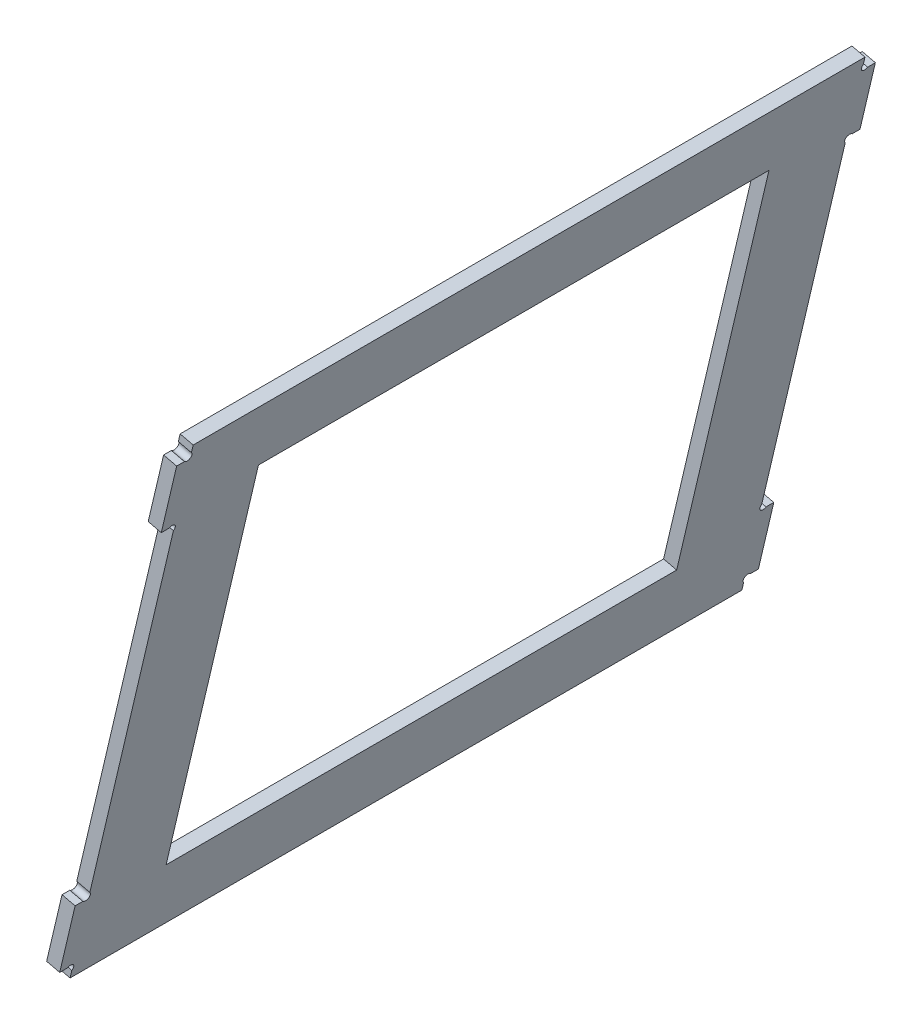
ISO-10303-21;
HEADER;
FILE_DESCRIPTION(('STEP AP214'),'2;1');
FILE_NAME('part.step','',(''),(''),'','','');
FILE_SCHEMA(('AUTOMOTIVE_DESIGN { 1 0 10303 214 1 1 1 1 }'));
ENDSEC;
DATA;
#1=APPLICATION_CONTEXT('core data for automotive mechanical design processes');
#2=APPLICATION_PROTOCOL_DEFINITION('international standard','automotive_design',2000,#1);
#3=PRODUCT_CONTEXT('',#1,'mechanical');
#4=PRODUCT('Part','Part','',(#3));
#5=PRODUCT_RELATED_PRODUCT_CATEGORY('part','',(#4));
#6=PRODUCT_DEFINITION_FORMATION('','',#4);
#7=PRODUCT_DEFINITION_CONTEXT('part definition',#1,'design');
#8=PRODUCT_DEFINITION('design','',#6,#7);
#9=PRODUCT_DEFINITION_SHAPE('','',#8);
#10=(LENGTH_UNIT() NAMED_UNIT(*) SI_UNIT(.MILLI.,.METRE.));
#11=(NAMED_UNIT(*) PLANE_ANGLE_UNIT() SI_UNIT($,.RADIAN.));
#12=(NAMED_UNIT(*) SI_UNIT($,.STERADIAN.) SOLID_ANGLE_UNIT());
#13=UNCERTAINTY_MEASURE_WITH_UNIT(LENGTH_MEASURE(1.E-05),#10,'distance_accuracy_value','');
#14=(GEOMETRIC_REPRESENTATION_CONTEXT(3) GLOBAL_UNCERTAINTY_ASSIGNED_CONTEXT((#13)) GLOBAL_UNIT_ASSIGNED_CONTEXT((#10,
#11,#12)) REPRESENTATION_CONTEXT('',''));
#15=CARTESIAN_POINT('',(0.,0.,0.));
#16=DIRECTION('',(0.,0.,1.));
#17=DIRECTION('',(1.,0.,0.));
#18=AXIS2_PLACEMENT_3D('',#15,#16,#17);
#19=CARTESIAN_POINT('',(-164.822751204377,648.878970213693,500.));
#20=DIRECTION('',(0.,0.,1.));
#21=DIRECTION('',(1.,0.,0.));
#22=AXIS2_PLACEMENT_3D('',#19,#20,#21);
#23=PLANE('',#22);
#24=DIRECTION('',(0.229075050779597,0.973408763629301,0.));
#25=VECTOR('',#24,1.);
#26=CARTESIAN_POINT('',(-228.485745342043,150.495036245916,500.));
#27=LINE('',#26,#25);
#28=CARTESIAN_POINT('',(-228.485745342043,150.495036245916,500.));
#29=VERTEX_POINT('',#28);
#30=CARTESIAN_POINT('',(-227.166877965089,156.099300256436,500.));
#31=VERTEX_POINT('',#30);
#32=EDGE_CURVE('E426',#29,#31,#27,.T.);
#33=ORIENTED_EDGE('',*,*,#32,.T.);
#34=DIRECTION('',(-0.973408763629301,0.2290750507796,0.));
#35=VECTOR('',#34,1.);
#36=CARTESIAN_POINT('',(-140.345177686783,135.667302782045,500.));
#37=LINE('',#36,#35);
#38=CARTESIAN_POINT('',(-236.900965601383,158.390050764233,500.));
#39=VERTEX_POINT('',#38);
#40=EDGE_CURVE('E273',#31,#39,#37,.T.);
#41=ORIENTED_EDGE('',*,*,#40,.T.);
#42=DIRECTION('',(-0.2290750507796,-0.973408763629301,0.));
#43=VECTOR('',#42,1.);
#44=CARTESIAN_POINT('',(-238.219832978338,152.785786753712,500.));
#45=LINE('',#44,#43);
#46=CARTESIAN_POINT('',(-238.219832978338,152.785786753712,500.));
#47=VERTEX_POINT('',#46);
#48=EDGE_CURVE('E438',#39,#47,#45,.T.);
#49=ORIENTED_EDGE('',*,*,#48,.T.);
#50=DIRECTION('',(0.973408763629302,-0.229075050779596,0.));
#51=VECTOR('',#50,1.);
#52=CARTESIAN_POINT('',(-238.219832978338,152.785786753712,500.));
#53=LINE('',#52,#51);
#54=EDGE_CURVE('E431',#47,#29,#53,.T.);
#55=ORIENTED_EDGE('',*,*,#54,.T.);
#56=EDGE_LOOP('',(#33,#41,#49,#55));
#57=FACE_BOUND('',#56,.T.);
#58=ADVANCED_FACE('F33',(#57),#23,.T.);
#59=CARTESIAN_POINT('',(-161.306198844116,479.6149427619,500.));
#60=VERTEX_POINT('',#59);
#61=CARTESIAN_POINT('',(-223.50344680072,215.320136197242,500.));
#62=VERTEX_POINT('',#61);
#63=EDGE_CURVE('E437',#60,#62,#45,.T.);
#64=ORIENTED_EDGE('',*,*,#63,.T.);
#65=DIRECTION('',(-0.973408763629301,0.2290750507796,0.));
#66=VECTOR('',#65,1.);
#67=CARTESIAN_POINT('',(-126.94765888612,192.597388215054,500.));
#68=LINE('',#67,#66);
#69=CARTESIAN_POINT('',(-213.769359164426,213.029385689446,500.));
#70=VERTEX_POINT('',#69);
#71=EDGE_CURVE('E254',#62,#70,#68,.F.);
#72=ORIENTED_EDGE('',*,*,#71,.T.);
#73=CARTESIAN_POINT('',(-151.572111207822,477.324192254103,500.));
#74=VERTEX_POINT('',#73);
#75=EDGE_CURVE('E253',#70,#74,#27,.T.);
#76=ORIENTED_EDGE('',*,*,#75,.T.);
#77=DIRECTION('',(-0.973408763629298,0.22907505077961,0.));
#78=VECTOR('',#77,1.);
#79=CARTESIAN_POINT('',(-64.7504109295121,456.89219477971,500.));
#80=LINE('',#79,#78);
#81=EDGE_CURVE('E280',#60,#74,#80,.F.);
#82=ORIENTED_EDGE('',*,*,#81,.F.);
#83=EDGE_LOOP('',(#64,#72,#76,#82));
#84=FACE_BOUND('',#83,.T.);
#85=ADVANCED_FACE('F497',(#84),#23,.T.);
#86=CARTESIAN_POINT('',(-226.194994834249,160.229123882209,500.));
#87=DIRECTION('',(0.2290750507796,0.973408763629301,0.));
#88=DIRECTION('',(-0.973408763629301,0.2290750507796,0.));
#89=AXIS2_PLACEMENT_3D('',#86,#87,#88);
#90=PLANE('',#89);
#91=DIRECTION('',(-0.973408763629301,0.2290750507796,0.));
#92=VECTOR('',#91,1.);
#93=CARTESIAN_POINT('',(-139.373294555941,139.797126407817,504.242640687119));
#94=LINE('',#93,#92);
#95=CARTESIAN_POINT('',(-226.194994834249,160.229123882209,504.242640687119));
#96=VERTEX_POINT('',#95);
#97=CARTESIAN_POINT('',(-235.929082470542,162.519874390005,504.242640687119));
#98=VERTEX_POINT('',#97);
#99=EDGE_CURVE('E11',#96,#98,#94,.T.);
#100=ORIENTED_EDGE('',*,*,#99,.F.);
#101=DIRECTION('',(0.,0.,-1.));
#102=VECTOR('',#101,1.);
#103=CARTESIAN_POINT('',(-226.194994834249,160.229123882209,500.));
#104=LINE('',#103,#102);
#105=CARTESIAN_POINT('',(-226.194994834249,160.229123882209,510.));
#106=VERTEX_POINT('',#105);
#107=EDGE_CURVE('E265',#106,#96,#104,.T.);
#108=ORIENTED_EDGE('',*,*,#107,.F.);
#109=DIRECTION('',(-0.973408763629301,0.2290750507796,0.));
#110=VECTOR('',#109,1.);
#111=CARTESIAN_POINT('',(-226.194994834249,160.229123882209,510.));
#112=LINE('',#111,#110);
#113=CARTESIAN_POINT('',(-235.929082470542,162.519874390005,510.));
#114=VERTEX_POINT('',#113);
#115=EDGE_CURVE('E260',#106,#114,#112,.T.);
#116=ORIENTED_EDGE('',*,*,#115,.T.);
#117=DIRECTION('',(0.,0.,-1.));
#118=VECTOR('',#117,1.);
#119=CARTESIAN_POINT('',(-235.929082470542,162.519874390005,500.));
#120=LINE('',#119,#118);
#121=EDGE_CURVE('E269',#114,#98,#120,.T.);
#122=ORIENTED_EDGE('',*,*,#121,.T.);
#123=EDGE_LOOP('',(#100,#108,#116,#122));
#124=FACE_BOUND('',#123,.T.);
#125=ADVANCED_FACE('F555',(#124),#90,.F.);
#126=CARTESIAN_POINT('',(-214.741242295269,208.899562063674,500.));
#127=DIRECTION('',(-0.2290750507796,-0.973408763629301,0.));
#128=DIRECTION('',(0.973408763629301,-0.2290750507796,0.));
#129=AXIS2_PLACEMENT_3D('',#126,#127,#128);
#130=PLANE('',#129);
#131=DIRECTION('',(-0.973408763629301,0.2290750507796,0.));
#132=VECTOR('',#131,1.);
#133=CARTESIAN_POINT('',(-127.919542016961,188.467564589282,504.242640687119));
#134=LINE('',#133,#132);
#135=CARTESIAN_POINT('',(-224.475329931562,211.19031257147,504.242640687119));
#136=VERTEX_POINT('',#135);
#137=CARTESIAN_POINT('',(-214.741242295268,208.899562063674,504.242640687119));
#138=VERTEX_POINT('',#137);
#139=EDGE_CURVE('E41',#136,#138,#134,.F.);
#140=ORIENTED_EDGE('',*,*,#139,.F.);
#141=DIRECTION('',(0.,0.,1.));
#142=VECTOR('',#141,1.);
#143=CARTESIAN_POINT('',(-224.475329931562,211.19031257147,500.));
#144=LINE('',#143,#142);
#145=CARTESIAN_POINT('',(-224.475329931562,211.19031257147,510.));
#146=VERTEX_POINT('',#145);
#147=EDGE_CURVE('E275',#136,#146,#144,.T.);
#148=ORIENTED_EDGE('',*,*,#147,.T.);
#149=DIRECTION('',(-0.973408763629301,0.2290750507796,0.));
#150=VECTOR('',#149,1.);
#151=CARTESIAN_POINT('',(-214.741242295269,208.899562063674,510.));
#152=LINE('',#151,#150);
#153=CARTESIAN_POINT('',(-214.741242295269,208.899562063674,510.));
#154=VERTEX_POINT('',#153);
#155=EDGE_CURVE('E258',#154,#146,#152,.T.);
#156=ORIENTED_EDGE('',*,*,#155,.F.);
#157=DIRECTION('',(0.,0.,1.));
#158=VECTOR('',#157,1.);
#159=CARTESIAN_POINT('',(-214.741242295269,208.899562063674,500.));
#160=LINE('',#159,#158);
#161=EDGE_CURVE('E250',#138,#154,#160,.T.);
#162=ORIENTED_EDGE('',*,*,#161,.F.);
#163=EDGE_LOOP('',(#140,#148,#156,#162));
#164=FACE_BOUND('',#163,.T.);
#165=ADVANCED_FACE('F256',(#164),#130,.F.);
#166=CARTESIAN_POINT('',(0.,0.,0.));
#167=DIRECTION('',(0.,0.,-1.));
#168=DIRECTION('',(-1.,0.,0.));
#169=AXIS2_PLACEMENT_3D('',#166,#167,#168);
#170=PLANE('',#169);
#171=DIRECTION('',(0.229075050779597,0.973408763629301,0.));
#172=VECTOR('',#171,1.);
#173=CARTESIAN_POINT('',(-228.485745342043,150.495036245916,0.));
#174=LINE('',#173,#172);
#175=CARTESIAN_POINT('',(-138.17459240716,534.254277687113,0.));
#176=VERTEX_POINT('',#175);
#177=CARTESIAN_POINT('',(-136.855725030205,539.858541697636,0.));
#178=VERTEX_POINT('',#177);
#179=EDGE_CURVE('E415',#176,#178,#174,.T.);
#180=ORIENTED_EDGE('',*,*,#179,.F.);
#181=DIRECTION('',(-0.973408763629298,0.22907505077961,0.));
#182=VECTOR('',#181,1.);
#183=CARTESIAN_POINT('',(-51.3528921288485,513.822280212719,0.));
#184=LINE('',#183,#182);
#185=CARTESIAN_POINT('',(-147.908680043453,536.545028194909,0.));
#186=VERTEX_POINT('',#185);
#187=EDGE_CURVE('E324',#176,#186,#184,.T.);
#188=ORIENTED_EDGE('',*,*,#187,.T.);
#189=DIRECTION('',(-0.2290750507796,-0.973408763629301,0.));
#190=VECTOR('',#189,1.);
#191=CARTESIAN_POINT('',(-238.219832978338,152.785786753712,0.));
#192=LINE('',#191,#190);
#193=CARTESIAN_POINT('',(-146.589812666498,542.149292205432,0.));
#194=VERTEX_POINT('',#193);
#195=EDGE_CURVE('E421',#194,#186,#192,.T.);
#196=ORIENTED_EDGE('',*,*,#195,.F.);
#197=DIRECTION('',(-0.973408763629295,0.229075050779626,0.));
#198=VECTOR('',#197,1.);
#199=CARTESIAN_POINT('',(-146.589812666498,542.149292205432,0.));
#200=LINE('',#199,#198);
#201=EDGE_CURVE('E406',#178,#194,#200,.T.);
#202=ORIENTED_EDGE('',*,*,#201,.F.);
#203=EDGE_LOOP('',(#180,#188,#196,#202));
#204=FACE_BOUND('',#203,.T.);
#205=ADVANCED_FACE('F537',(#204),#170,.T.);
#206=CARTESIAN_POINT('',(-161.306198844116,479.6149427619,0.));
#207=VERTEX_POINT('',#206);
#208=CARTESIAN_POINT('',(-223.50344680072,215.320136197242,0.));
#209=VERTEX_POINT('',#208);
#210=EDGE_CURVE('E424',#207,#209,#192,.T.);
#211=ORIENTED_EDGE('',*,*,#210,.F.);
#212=DIRECTION('',(-0.973408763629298,0.22907505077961,0.));
#213=VECTOR('',#212,1.);
#214=CARTESIAN_POINT('',(-64.750410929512,456.89219477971,0.));
#215=LINE('',#214,#213);
#216=CARTESIAN_POINT('',(-151.572111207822,477.324192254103,0.));
#217=VERTEX_POINT('',#216);
#218=EDGE_CURVE('E311',#207,#217,#215,.F.);
#219=ORIENTED_EDGE('',*,*,#218,.T.);
#220=CARTESIAN_POINT('',(-213.769359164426,213.029385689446,0.));
#221=VERTEX_POINT('',#220);
#222=EDGE_CURVE('E414',#221,#217,#174,.T.);
#223=ORIENTED_EDGE('',*,*,#222,.F.);
#224=DIRECTION('',(-0.973408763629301,0.2290750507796,0.));
#225=VECTOR('',#224,1.);
#226=CARTESIAN_POINT('',(-126.94765888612,192.597388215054,0.));
#227=LINE('',#226,#225);
#228=EDGE_CURVE('E350',#209,#221,#227,.F.);
#229=ORIENTED_EDGE('',*,*,#228,.F.);
#230=EDGE_LOOP('',(#211,#219,#223,#229));
#231=FACE_BOUND('',#230,.T.);
#232=ADVANCED_FACE('F525',(#231),#170,.T.);
#233=CARTESIAN_POINT('',(-139.146475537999,530.12445406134,0.));
#234=DIRECTION('',(-0.22907505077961,-0.973408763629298,0.));
#235=DIRECTION('',(0.973408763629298,-0.22907505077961,0.));
#236=AXIS2_PLACEMENT_3D('',#233,#234,#235);
#237=PLANE('',#236);
#238=DIRECTION('',(-0.973408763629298,0.22907505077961,0.));
#239=VECTOR('',#238,1.);
#240=CARTESIAN_POINT('',(-52.32477525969,509.692456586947,-4.24264068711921));
#241=LINE('',#240,#239);
#242=CARTESIAN_POINT('',(-139.146475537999,530.12445406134,-4.24264068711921));
#243=VERTEX_POINT('',#242);
#244=CARTESIAN_POINT('',(-148.880563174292,532.415204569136,-4.24264068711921));
#245=VERTEX_POINT('',#244);
#246=EDGE_CURVE('E466',#243,#245,#241,.T.);
#247=ORIENTED_EDGE('',*,*,#246,.F.);
#248=DIRECTION('',(0.,0.,1.));
#249=VECTOR('',#248,1.);
#250=CARTESIAN_POINT('',(-139.146475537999,530.12445406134,0.));
#251=LINE('',#250,#249);
#252=CARTESIAN_POINT('',(-139.146475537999,530.12445406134,-10.));
#253=VERTEX_POINT('',#252);
#254=EDGE_CURVE('E328',#253,#243,#251,.T.);
#255=ORIENTED_EDGE('',*,*,#254,.F.);
#256=DIRECTION('',(-0.973408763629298,0.22907505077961,0.));
#257=VECTOR('',#256,1.);
#258=CARTESIAN_POINT('',(-139.146475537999,530.12445406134,-10.));
#259=LINE('',#258,#257);
#260=CARTESIAN_POINT('',(-148.880563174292,532.415204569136,-10.));
#261=VERTEX_POINT('',#260);
#262=EDGE_CURVE('E336',#253,#261,#259,.T.);
#263=ORIENTED_EDGE('',*,*,#262,.T.);
#264=DIRECTION('',(0.,0.,1.));
#265=VECTOR('',#264,1.);
#266=CARTESIAN_POINT('',(-148.880563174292,532.415204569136,0.));
#267=LINE('',#266,#265);
#268=EDGE_CURVE('E327',#261,#245,#267,.T.);
#269=ORIENTED_EDGE('',*,*,#268,.T.);
#270=EDGE_LOOP('',(#247,#255,#263,#269));
#271=FACE_BOUND('',#270,.T.);
#272=ADVANCED_FACE('F590',(#271),#237,.F.);
#273=CARTESIAN_POINT('',(-150.60022807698,481.454015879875,0.));
#274=DIRECTION('',(0.22907505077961,0.973408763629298,0.));
#275=DIRECTION('',(-0.973408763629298,0.22907505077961,0.));
#276=AXIS2_PLACEMENT_3D('',#273,#274,#275);
#277=PLANE('',#276);
#278=DIRECTION('',(-0.973408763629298,0.22907505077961,0.));
#279=VECTOR('',#278,1.);
#280=CARTESIAN_POINT('',(-63.7785277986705,461.022018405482,-4.24264068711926));
#281=LINE('',#280,#279);
#282=CARTESIAN_POINT('',(-160.334315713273,483.744766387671,-4.24264068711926));
#283=VERTEX_POINT('',#282);
#284=CARTESIAN_POINT('',(-150.60022807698,481.454015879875,-4.24264068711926));
#285=VERTEX_POINT('',#284);
#286=EDGE_CURVE('E464',#283,#285,#281,.F.);
#287=ORIENTED_EDGE('',*,*,#286,.F.);
#288=DIRECTION('',(0.,0.,-1.));
#289=VECTOR('',#288,1.);
#290=CARTESIAN_POINT('',(-160.334315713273,483.744766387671,0.));
#291=LINE('',#290,#289);
#292=CARTESIAN_POINT('',(-160.334315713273,483.744766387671,-10.));
#293=VERTEX_POINT('',#292);
#294=EDGE_CURVE('E332',#283,#293,#291,.T.);
#295=ORIENTED_EDGE('',*,*,#294,.T.);
#296=DIRECTION('',(-0.973408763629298,0.22907505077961,0.));
#297=VECTOR('',#296,1.);
#298=CARTESIAN_POINT('',(-150.60022807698,481.454015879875,-10.));
#299=LINE('',#298,#297);
#300=CARTESIAN_POINT('',(-150.60022807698,481.454015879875,-10.));
#301=VERTEX_POINT('',#300);
#302=EDGE_CURVE('E342',#301,#293,#299,.T.);
#303=ORIENTED_EDGE('',*,*,#302,.F.);
#304=DIRECTION('',(0.,0.,-1.));
#305=VECTOR('',#304,1.);
#306=CARTESIAN_POINT('',(-150.60022807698,481.454015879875,0.));
#307=LINE('',#306,#305);
#308=EDGE_CURVE('E334',#285,#301,#307,.T.);
#309=ORIENTED_EDGE('',*,*,#308,.F.);
#310=EDGE_LOOP('',(#287,#295,#303,#309));
#311=FACE_BOUND('',#310,.T.);
#312=ADVANCED_FACE('F587',(#311),#277,.F.);
#313=CARTESIAN_POINT('',(-238.219832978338,152.785786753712,904.558696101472));
#314=DIRECTION('',(0.973408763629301,-0.2290750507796,0.));
#315=DIRECTION('',(0.2290750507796,0.973408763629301,0.));
#316=AXIS2_PLACEMENT_3D('',#313,#314,#315);
#317=PLANE('',#316);
#318=ORIENTED_EDGE('',*,*,#48,.F.);
#319=CARTESIAN_POINT('',(-236.415024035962,160.454962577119,502.12132034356));
#320=DIRECTION('',(0.973408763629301,-0.2290750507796,0.));
#321=DIRECTION('',(0.2290750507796,0.973408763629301,0.));
#322=AXIS2_PLACEMENT_3D('',#319,#320,#321);
#323=CIRCLE('',#322,3.00000000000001);
#324=EDGE_CURVE('E861',#98,#39,#323,.F.);
#325=ORIENTED_EDGE('',*,*,#324,.F.);
#326=ORIENTED_EDGE('',*,*,#121,.F.);
#327=DIRECTION('',(-0.2290750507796,-0.973408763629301,0.));
#328=VECTOR('',#327,1.);
#329=CARTESIAN_POINT('',(-235.929082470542,162.519874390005,510.));
#330=LINE('',#329,#328);
#331=EDGE_CURVE('E272',#146,#114,#330,.T.);
#332=ORIENTED_EDGE('',*,*,#331,.F.);
#333=ORIENTED_EDGE('',*,*,#147,.F.);
#334=CARTESIAN_POINT('',(-223.989388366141,213.255224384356,502.12132034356));
#335=DIRECTION('',(0.973408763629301,-0.2290750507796,0.));
#336=DIRECTION('',(0.2290750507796,0.973408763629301,0.));
#337=AXIS2_PLACEMENT_3D('',#334,#335,#336);
#338=CIRCLE('',#337,3.);
#339=EDGE_CURVE('E55',#62,#136,#338,.F.);
#340=ORIENTED_EDGE('',*,*,#339,.F.);
#341=ORIENTED_EDGE('',*,*,#63,.F.);
#342=CARTESIAN_POINT('',(-160.820257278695,481.679854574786,502.12132034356));
#343=DIRECTION('',(0.973408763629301,-0.2290750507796,0.));
#344=DIRECTION('',(0.2290750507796,0.973408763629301,0.));
#345=AXIS2_PLACEMENT_3D('',#342,#343,#344);
#346=CIRCLE('',#345,3.);
#347=CARTESIAN_POINT('',(-160.334315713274,483.744766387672,504.242640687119));
#348=VERTEX_POINT('',#347);
#349=EDGE_CURVE('E281',#60,#348,#346,.T.);
#350=ORIENTED_EDGE('',*,*,#349,.T.);
#351=DIRECTION('',(0.,0.,1.));
#352=VECTOR('',#351,1.);
#353=CARTESIAN_POINT('',(-160.334315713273,483.744766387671,500.));
#354=LINE('',#353,#352);
#355=CARTESIAN_POINT('',(-160.334315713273,483.744766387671,510.));
#356=VERTEX_POINT('',#355);
#357=EDGE_CURVE('E305',#348,#356,#354,.T.);
#358=ORIENTED_EDGE('',*,*,#357,.T.);
#359=DIRECTION('',(0.22907505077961,0.973408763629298,0.));
#360=VECTOR('',#359,1.);
#361=CARTESIAN_POINT('',(-148.880563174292,532.415204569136,510.));
#362=LINE('',#361,#360);
#363=CARTESIAN_POINT('',(-148.880563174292,532.415204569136,510.));
#364=VERTEX_POINT('',#363);
#365=EDGE_CURVE('E297',#356,#364,#362,.T.);
#366=ORIENTED_EDGE('',*,*,#365,.T.);
#367=DIRECTION('',(0.,0.,-1.));
#368=VECTOR('',#367,1.);
#369=CARTESIAN_POINT('',(-148.880563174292,532.415204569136,500.));
#370=LINE('',#369,#368);
#371=CARTESIAN_POINT('',(-148.880563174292,532.415204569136,504.242640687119));
#372=VERTEX_POINT('',#371);
#373=EDGE_CURVE('E291',#364,#372,#370,.T.);
#374=ORIENTED_EDGE('',*,*,#373,.T.);
#375=CARTESIAN_POINT('',(-148.394621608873,534.480116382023,502.12132034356));
#376=DIRECTION('',(0.973408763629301,-0.2290750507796,0.));
#377=DIRECTION('',(0.2290750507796,0.973408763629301,0.));
#378=AXIS2_PLACEMENT_3D('',#375,#376,#377);
#379=CIRCLE('',#378,3.00000000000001);
#380=CARTESIAN_POINT('',(-147.908680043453,536.545028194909,500.));
#381=VERTEX_POINT('',#380);
#382=EDGE_CURVE('E288',#372,#381,#379,.T.);
#383=ORIENTED_EDGE('',*,*,#382,.T.);
#384=CARTESIAN_POINT('',(-146.589812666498,542.149292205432,500.));
#385=VERTEX_POINT('',#384);
#386=EDGE_CURVE('E434',#385,#381,#45,.T.);
#387=ORIENTED_EDGE('',*,*,#386,.F.);
#388=DIRECTION('',(0.,0.,-1.));
#389=VECTOR('',#388,1.);
#390=CARTESIAN_POINT('',(-146.589812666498,542.149292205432,904.558696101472));
#391=LINE('',#390,#389);
#392=EDGE_CURVE('E405',#385,#194,#391,.T.);
#393=ORIENTED_EDGE('',*,*,#392,.T.);
#394=ORIENTED_EDGE('',*,*,#195,.T.);
#395=CARTESIAN_POINT('',(-148.394621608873,534.480116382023,-2.12132034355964));
#396=DIRECTION('',(0.973408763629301,-0.2290750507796,0.));
#397=DIRECTION('',(0.2290750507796,0.973408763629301,0.));
#398=AXIS2_PLACEMENT_3D('',#395,#396,#397);
#399=CIRCLE('',#398,3.00000000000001);
#400=EDGE_CURVE('E322',#245,#186,#399,.F.);
#401=ORIENTED_EDGE('',*,*,#400,.F.);
#402=ORIENTED_EDGE('',*,*,#268,.F.);
#403=DIRECTION('',(0.22907505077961,0.973408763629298,0.));
#404=VECTOR('',#403,1.);
#405=CARTESIAN_POINT('',(-148.880563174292,532.415204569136,-10.));
#406=LINE('',#405,#404);
#407=EDGE_CURVE('E339',#293,#261,#406,.T.);
#408=ORIENTED_EDGE('',*,*,#407,.F.);
#409=ORIENTED_EDGE('',*,*,#294,.F.);
#410=CARTESIAN_POINT('',(-160.820257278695,481.679854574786,-2.12132034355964));
#411=DIRECTION('',(0.973408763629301,-0.2290750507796,0.));
#412=DIRECTION('',(0.2290750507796,0.973408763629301,0.));
#413=AXIS2_PLACEMENT_3D('',#410,#411,#412);
#414=CIRCLE('',#413,3.);
#415=EDGE_CURVE('E316',#207,#283,#414,.F.);
#416=ORIENTED_EDGE('',*,*,#415,.F.);
#417=ORIENTED_EDGE('',*,*,#210,.T.);
#418=CARTESIAN_POINT('',(-223.989388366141,213.255224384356,-2.12132034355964));
#419=DIRECTION('',(0.973408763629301,-0.2290750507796,0.));
#420=DIRECTION('',(0.2290750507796,0.973408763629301,0.));
#421=AXIS2_PLACEMENT_3D('',#418,#419,#420);
#422=CIRCLE('',#421,3.);
#423=CARTESIAN_POINT('',(-224.475329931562,211.19031257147,-4.24264068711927));
#424=VERTEX_POINT('',#423);
#425=EDGE_CURVE('E351',#209,#424,#422,.T.);
#426=ORIENTED_EDGE('',*,*,#425,.T.);
#427=DIRECTION('',(0.,0.,-1.));
#428=VECTOR('',#427,1.);
#429=CARTESIAN_POINT('',(-224.475329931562,211.19031257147,0.));
#430=LINE('',#429,#428);
#431=CARTESIAN_POINT('',(-224.475329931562,211.19031257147,-10.));
#432=VERTEX_POINT('',#431);
#433=EDGE_CURVE('E374',#424,#432,#430,.T.);
#434=ORIENTED_EDGE('',*,*,#433,.T.);
#435=DIRECTION('',(-0.2290750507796,-0.973408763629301,0.));
#436=VECTOR('',#435,1.);
#437=CARTESIAN_POINT('',(-235.929082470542,162.519874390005,-10.));
#438=LINE('',#437,#436);
#439=CARTESIAN_POINT('',(-235.929082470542,162.519874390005,-10.));
#440=VERTEX_POINT('',#439);
#441=EDGE_CURVE('E366',#432,#440,#438,.T.);
#442=ORIENTED_EDGE('',*,*,#441,.T.);
#443=DIRECTION('',(0.,0.,1.));
#444=VECTOR('',#443,1.);
#445=CARTESIAN_POINT('',(-235.929082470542,162.519874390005,0.));
#446=LINE('',#445,#444);
#447=CARTESIAN_POINT('',(-235.929082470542,162.519874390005,-4.24264068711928));
#448=VERTEX_POINT('',#447);
#449=EDGE_CURVE('E361',#440,#448,#446,.T.);
#450=ORIENTED_EDGE('',*,*,#449,.T.);
#451=CARTESIAN_POINT('',(-236.415024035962,160.454962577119,-2.12132034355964));
#452=DIRECTION('',(0.973408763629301,-0.2290750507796,0.));
#453=DIRECTION('',(0.2290750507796,0.973408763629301,0.));
#454=AXIS2_PLACEMENT_3D('',#451,#452,#453);
#455=CIRCLE('',#454,3.00000000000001);
#456=CARTESIAN_POINT('',(-236.900965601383,158.390050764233,0.));
#457=VERTEX_POINT('',#456);
#458=EDGE_CURVE('E356',#448,#457,#455,.T.);
#459=ORIENTED_EDGE('',*,*,#458,.T.);
#460=CARTESIAN_POINT('',(-238.219832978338,152.785786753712,0.));
#461=VERTEX_POINT('',#460);
#462=EDGE_CURVE('E425',#457,#461,#192,.T.);
#463=ORIENTED_EDGE('',*,*,#462,.T.);
#464=DIRECTION('',(0.,0.,-1.));
#465=VECTOR('',#464,1.);
#466=CARTESIAN_POINT('',(-238.219832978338,152.785786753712,904.558696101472));
#467=LINE('',#466,#465);
#468=EDGE_CURVE('E420',#47,#461,#467,.T.);
#469=ORIENTED_EDGE('',*,*,#468,.F.);
#470=EDGE_LOOP('',(#318,#325,#326,#332,#333,#340,#341,#350,#358,#366,#374,#383,#387,#393,#394,
#401,#402,#408,#409,#416,#417,#426,#434,#442,#450,#459,#463,#469));
#471=FACE_BOUND('',#470,.T.);
#472=DIRECTION('',(0.,0.,-1.));
#473=VECTOR('',#472,1.);
#474=CARTESIAN_POINT('',(-226.766080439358,201.456224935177,904.558696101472));
#475=LINE('',#474,#473);
#476=CARTESIAN_POINT('',(-226.766080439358,201.456224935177,440.));
#477=VERTEX_POINT('',#476);
#478=CARTESIAN_POINT('',(-226.766080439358,201.456224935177,60.0000000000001));
#479=VERTEX_POINT('',#478);
#480=EDGE_CURVE('E386',#477,#479,#475,.T.);
#481=ORIENTED_EDGE('',*,*,#480,.T.);
#482=DIRECTION('',(0.2290750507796,0.973408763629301,0.));
#483=VECTOR('',#482,1.);
#484=CARTESIAN_POINT('',(-238.219832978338,152.785786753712,60.0000000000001));
#485=LINE('',#484,#483);
#486=CARTESIAN_POINT('',(-158.043565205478,493.478854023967,60.0000000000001));
#487=VERTEX_POINT('',#486);
#488=EDGE_CURVE('E402',#479,#487,#485,.T.);
#489=ORIENTED_EDGE('',*,*,#488,.T.);
#490=DIRECTION('',(0.,0.,1.));
#491=VECTOR('',#490,1.);
#492=CARTESIAN_POINT('',(-158.043565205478,493.478854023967,904.558696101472));
#493=LINE('',#492,#491);
#494=CARTESIAN_POINT('',(-158.043565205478,493.478854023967,440.));
#495=VERTEX_POINT('',#494);
#496=EDGE_CURVE('E399',#487,#495,#493,.T.);
#497=ORIENTED_EDGE('',*,*,#496,.T.);
#498=DIRECTION('',(-0.2290750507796,-0.973408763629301,0.));
#499=VECTOR('',#498,1.);
#500=CARTESIAN_POINT('',(-238.219832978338,152.785786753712,440.));
#501=LINE('',#500,#499);
#502=EDGE_CURVE('E396',#495,#477,#501,.T.);
#503=ORIENTED_EDGE('',*,*,#502,.T.);
#504=EDGE_LOOP('',(#481,#489,#497,#503));
#505=FACE_BOUND('',#504,.T.);
#506=ADVANCED_FACE('F500',(#471,#505),#317,.F.);
#507=CARTESIAN_POINT('',(-238.219832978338,152.785786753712,904.558696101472));
#508=DIRECTION('',(0.229075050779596,0.973408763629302,0.));
#509=DIRECTION('',(-0.973408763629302,0.229075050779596,0.));
#510=AXIS2_PLACEMENT_3D('',#507,#508,#509);
#511=PLANE('',#510);
#512=ORIENTED_EDGE('',*,*,#54,.F.);
#513=ORIENTED_EDGE('',*,*,#468,.T.);
#514=DIRECTION('',(0.973408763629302,-0.229075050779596,0.));
#515=VECTOR('',#514,1.);
#516=CARTESIAN_POINT('',(-238.219832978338,152.785786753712,0.));
#517=LINE('',#516,#515);
#518=CARTESIAN_POINT('',(-228.485745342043,150.495036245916,0.));
#519=VERTEX_POINT('',#518);
#520=EDGE_CURVE('E416',#461,#519,#517,.T.);
#521=ORIENTED_EDGE('',*,*,#520,.T.);
#522=DIRECTION('',(0.,0.,-1.));
#523=VECTOR('',#522,1.);
#524=CARTESIAN_POINT('',(-228.485745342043,150.495036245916,904.558696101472));
#525=LINE('',#524,#523);
#526=EDGE_CURVE('E419',#29,#519,#525,.T.);
#527=ORIENTED_EDGE('',*,*,#526,.F.);
#528=EDGE_LOOP('',(#512,#513,#521,#527));
#529=FACE_BOUND('',#528,.T.);
#530=ADVANCED_FACE('F509',(#529),#511,.F.);
#531=CARTESIAN_POINT('',(-228.485745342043,150.495036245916,904.558696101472));
#532=DIRECTION('',(-0.973408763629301,0.229075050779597,0.));
#533=DIRECTION('',(-0.229075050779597,-0.973408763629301,0.));
#534=AXIS2_PLACEMENT_3D('',#531,#532,#533);
#535=PLANE('',#534);
#536=CARTESIAN_POINT('',(-226.680936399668,158.164212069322,502.12132034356));
#537=DIRECTION('',(-0.973408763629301,0.229075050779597,0.));
#538=DIRECTION('',(-0.229075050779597,-0.973408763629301,0.));
#539=AXIS2_PLACEMENT_3D('',#536,#537,#538);
#540=CIRCLE('',#539,3.00000000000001);
#541=EDGE_CURVE('E47',#31,#96,#540,.F.);
#542=ORIENTED_EDGE('',*,*,#541,.F.);
#543=ORIENTED_EDGE('',*,*,#32,.F.);
#544=ORIENTED_EDGE('',*,*,#526,.T.);
#545=CARTESIAN_POINT('',(-227.166877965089,156.099300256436,0.));
#546=VERTEX_POINT('',#545);
#547=EDGE_CURVE('E411',#519,#546,#174,.T.);
#548=ORIENTED_EDGE('',*,*,#547,.T.);
#549=CARTESIAN_POINT('',(-226.680936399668,158.164212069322,-2.12132034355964));
#550=DIRECTION('',(-0.973408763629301,0.229075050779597,0.));
#551=DIRECTION('',(-0.229075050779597,-0.973408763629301,0.));
#552=AXIS2_PLACEMENT_3D('',#549,#550,#551);
#553=CIRCLE('',#552,3.00000000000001);
#554=CARTESIAN_POINT('',(-226.194994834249,160.229123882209,-4.24264068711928));
#555=VERTEX_POINT('',#554);
#556=EDGE_CURVE('E353',#546,#555,#553,.T.);
#557=ORIENTED_EDGE('',*,*,#556,.T.);
#558=DIRECTION('',(0.,0.,1.));
#559=VECTOR('',#558,1.);
#560=CARTESIAN_POINT('',(-226.194994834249,160.229123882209,0.));
#561=LINE('',#560,#559);
#562=CARTESIAN_POINT('',(-226.194994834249,160.229123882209,-10.));
#563=VERTEX_POINT('',#562);
#564=EDGE_CURVE('E362',#563,#555,#561,.T.);
#565=ORIENTED_EDGE('',*,*,#564,.F.);
#566=DIRECTION('',(-0.2290750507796,-0.973408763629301,0.));
#567=VECTOR('',#566,1.);
#568=CARTESIAN_POINT('',(-226.194994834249,160.229123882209,-10.));
#569=LINE('',#568,#567);
#570=CARTESIAN_POINT('',(-214.741242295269,208.899562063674,-10.));
#571=VERTEX_POINT('',#570);
#572=EDGE_CURVE('E368',#571,#563,#569,.T.);
#573=ORIENTED_EDGE('',*,*,#572,.F.);
#574=DIRECTION('',(0.,0.,-1.));
#575=VECTOR('',#574,1.);
#576=CARTESIAN_POINT('',(-214.741242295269,208.899562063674,0.));
#577=LINE('',#576,#575);
#578=CARTESIAN_POINT('',(-214.741242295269,208.899562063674,-4.24264068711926));
#579=VERTEX_POINT('',#578);
#580=EDGE_CURVE('E365',#579,#571,#577,.T.);
#581=ORIENTED_EDGE('',*,*,#580,.F.);
#582=CARTESIAN_POINT('',(-214.255300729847,210.96447387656,-2.12132034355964));
#583=DIRECTION('',(-0.973408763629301,0.229075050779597,0.));
#584=DIRECTION('',(-0.229075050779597,-0.973408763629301,0.));
#585=AXIS2_PLACEMENT_3D('',#582,#583,#584);
#586=CIRCLE('',#585,3.);
#587=EDGE_CURVE('E345',#579,#221,#586,.T.);
#588=ORIENTED_EDGE('',*,*,#587,.T.);
#589=ORIENTED_EDGE('',*,*,#222,.T.);
#590=CARTESIAN_POINT('',(-151.086169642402,479.38910406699,-2.12132034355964));
#591=DIRECTION('',(-0.973408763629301,0.229075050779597,0.));
#592=DIRECTION('',(-0.229075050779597,-0.973408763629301,0.));
#593=AXIS2_PLACEMENT_3D('',#590,#591,#592);
#594=CIRCLE('',#593,3.);
#595=EDGE_CURVE('E314',#285,#217,#594,.F.);
#596=ORIENTED_EDGE('',*,*,#595,.F.);
#597=ORIENTED_EDGE('',*,*,#308,.T.);
#598=DIRECTION('',(0.22907505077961,0.973408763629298,0.));
#599=VECTOR('',#598,1.);
#600=CARTESIAN_POINT('',(-139.146475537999,530.12445406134,-10.));
#601=LINE('',#600,#599);
#602=EDGE_CURVE('E331',#301,#253,#601,.T.);
#603=ORIENTED_EDGE('',*,*,#602,.T.);
#604=ORIENTED_EDGE('',*,*,#254,.T.);
#605=CARTESIAN_POINT('',(-138.66053397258,532.189365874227,-2.12132034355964));
#606=DIRECTION('',(-0.973408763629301,0.229075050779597,0.));
#607=DIRECTION('',(-0.229075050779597,-0.973408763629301,0.));
#608=AXIS2_PLACEMENT_3D('',#605,#606,#607);
#609=CIRCLE('',#608,3.00000000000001);
#610=EDGE_CURVE('E318',#176,#243,#609,.F.);
#611=ORIENTED_EDGE('',*,*,#610,.F.);
#612=ORIENTED_EDGE('',*,*,#179,.T.);
#613=DIRECTION('',(0.,0.,-1.));
#614=VECTOR('',#613,1.);
#615=CARTESIAN_POINT('',(-136.855725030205,539.858541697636,904.558696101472));
#616=LINE('',#615,#614);
#617=CARTESIAN_POINT('',(-136.855725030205,539.858541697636,500.));
#618=VERTEX_POINT('',#617);
#619=EDGE_CURVE('E410',#618,#178,#616,.T.);
#620=ORIENTED_EDGE('',*,*,#619,.F.);
#621=CARTESIAN_POINT('',(-138.17459240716,534.254277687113,500.));
#622=VERTEX_POINT('',#621);
#623=EDGE_CURVE('E430',#622,#618,#27,.T.);
#624=ORIENTED_EDGE('',*,*,#623,.F.);
#625=CARTESIAN_POINT('',(-138.66053397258,532.189365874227,502.12132034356));
#626=DIRECTION('',(-0.973408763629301,0.229075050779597,0.));
#627=DIRECTION('',(-0.229075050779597,-0.973408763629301,0.));
#628=AXIS2_PLACEMENT_3D('',#625,#626,#627);
#629=CIRCLE('',#628,3.00000000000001);
#630=CARTESIAN_POINT('',(-139.146475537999,530.12445406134,504.242640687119));
#631=VERTEX_POINT('',#630);
#632=EDGE_CURVE('E283',#622,#631,#629,.T.);
#633=ORIENTED_EDGE('',*,*,#632,.T.);
#634=DIRECTION('',(0.,0.,-1.));
#635=VECTOR('',#634,1.);
#636=CARTESIAN_POINT('',(-139.146475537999,530.12445406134,500.));
#637=LINE('',#636,#635);
#638=CARTESIAN_POINT('',(-139.146475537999,530.12445406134,510.));
#639=VERTEX_POINT('',#638);
#640=EDGE_CURVE('E293',#639,#631,#637,.T.);
#641=ORIENTED_EDGE('',*,*,#640,.F.);
#642=DIRECTION('',(0.22907505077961,0.973408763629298,0.));
#643=VECTOR('',#642,1.);
#644=CARTESIAN_POINT('',(-139.146475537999,530.12445406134,510.));
#645=LINE('',#644,#643);
#646=CARTESIAN_POINT('',(-150.60022807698,481.454015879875,510.));
#647=VERTEX_POINT('',#646);
#648=EDGE_CURVE('E299',#647,#639,#645,.T.);
#649=ORIENTED_EDGE('',*,*,#648,.F.);
#650=DIRECTION('',(0.,0.,1.));
#651=VECTOR('',#650,1.);
#652=CARTESIAN_POINT('',(-150.60022807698,481.454015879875,500.));
#653=LINE('',#652,#651);
#654=CARTESIAN_POINT('',(-150.60022807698,481.454015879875,504.242640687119));
#655=VERTEX_POINT('',#654);
#656=EDGE_CURVE('E296',#655,#647,#653,.T.);
#657=ORIENTED_EDGE('',*,*,#656,.F.);
#658=CARTESIAN_POINT('',(-151.086169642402,479.38910406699,502.12132034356));
#659=DIRECTION('',(-0.973408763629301,0.229075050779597,0.));
#660=DIRECTION('',(-0.229075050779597,-0.973408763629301,0.));
#661=AXIS2_PLACEMENT_3D('',#658,#659,#660);
#662=CIRCLE('',#661,3.);
#663=EDGE_CURVE('E277',#655,#74,#662,.T.);
#664=ORIENTED_EDGE('',*,*,#663,.T.);
#665=ORIENTED_EDGE('',*,*,#75,.F.);
#666=CARTESIAN_POINT('',(-214.255300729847,210.96447387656,502.12132034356));
#667=DIRECTION('',(-0.973408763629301,0.229075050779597,0.));
#668=DIRECTION('',(-0.229075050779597,-0.973408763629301,0.));
#669=AXIS2_PLACEMENT_3D('',#666,#667,#668);
#670=CIRCLE('',#669,3.);
#671=EDGE_CURVE('E240',#138,#70,#670,.F.);
#672=ORIENTED_EDGE('',*,*,#671,.F.);
#673=ORIENTED_EDGE('',*,*,#161,.T.);
#674=DIRECTION('',(-0.2290750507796,-0.973408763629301,0.));
#675=VECTOR('',#674,1.);
#676=CARTESIAN_POINT('',(-226.194994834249,160.229123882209,510.));
#677=LINE('',#676,#675);
#678=EDGE_CURVE('E261',#154,#106,#677,.T.);
#679=ORIENTED_EDGE('',*,*,#678,.T.);
#680=ORIENTED_EDGE('',*,*,#107,.T.);
#681=EDGE_LOOP('',(#542,#543,#544,#548,#557,#565,#573,#581,#588,#589,#596,#597,#603,#604,#611,
#612,#620,#624,#633,#641,#649,#657,#664,#665,#672,#673,#679,#680));
#682=FACE_BOUND('',#681,.T.);
#683=DIRECTION('',(0.,0.,-1.));
#684=VECTOR('',#683,1.);
#685=CARTESIAN_POINT('',(-148.309477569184,491.188103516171,904.558696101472));
#686=LINE('',#685,#684);
#687=CARTESIAN_POINT('',(-148.309477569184,491.188103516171,440.));
#688=VERTEX_POINT('',#687);
#689=CARTESIAN_POINT('',(-148.309477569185,491.188103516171,60.0000000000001));
#690=VERTEX_POINT('',#689);
#691=EDGE_CURVE('E452',#688,#690,#686,.T.);
#692=ORIENTED_EDGE('',*,*,#691,.T.);
#693=DIRECTION('',(-0.229075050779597,-0.973408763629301,0.));
#694=VECTOR('',#693,1.);
#695=CARTESIAN_POINT('',(-228.485745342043,150.495036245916,60.0000000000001));
#696=LINE('',#695,#694);
#697=CARTESIAN_POINT('',(-217.031992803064,199.165474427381,60.0000000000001));
#698=VERTEX_POINT('',#697);
#699=EDGE_CURVE('E455',#690,#698,#696,.T.);
#700=ORIENTED_EDGE('',*,*,#699,.T.);
#701=DIRECTION('',(0.,0.,1.));
#702=VECTOR('',#701,1.);
#703=CARTESIAN_POINT('',(-217.031992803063,199.165474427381,904.558696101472));
#704=LINE('',#703,#702);
#705=CARTESIAN_POINT('',(-217.031992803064,199.165474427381,440.));
#706=VERTEX_POINT('',#705);
#707=EDGE_CURVE('E429',#698,#706,#704,.T.);
#708=ORIENTED_EDGE('',*,*,#707,.T.);
#709=DIRECTION('',(0.229075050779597,0.973408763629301,0.));
#710=VECTOR('',#709,1.);
#711=CARTESIAN_POINT('',(-228.485745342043,150.495036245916,440.));
#712=LINE('',#711,#710);
#713=EDGE_CURVE('E449',#706,#688,#712,.T.);
#714=ORIENTED_EDGE('',*,*,#713,.T.);
#715=EDGE_LOOP('',(#692,#700,#708,#714));
#716=FACE_BOUND('',#715,.T.);
#717=ADVANCED_FACE('F248',(#682,#716),#535,.F.);
#718=CARTESIAN_POINT('',(-146.589812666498,542.149292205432,904.558696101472));
#719=DIRECTION('',(-0.229075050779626,-0.973408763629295,0.));
#720=DIRECTION('',(0.973408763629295,-0.229075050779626,0.));
#721=AXIS2_PLACEMENT_3D('',#718,#719,#720);
#722=PLANE('',#721);
#723=DIRECTION('',(-0.973408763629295,0.229075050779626,0.));
#724=VECTOR('',#723,1.);
#725=CARTESIAN_POINT('',(-146.589812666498,542.149292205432,500.));
#726=LINE('',#725,#724);
#727=EDGE_CURVE('E409',#618,#385,#726,.T.);
#728=ORIENTED_EDGE('',*,*,#727,.F.);
#729=ORIENTED_EDGE('',*,*,#619,.T.);
#730=ORIENTED_EDGE('',*,*,#201,.T.);
#731=ORIENTED_EDGE('',*,*,#392,.F.);
#732=EDGE_LOOP('',(#728,#729,#730,#731));
#733=FACE_BOUND('',#732,.T.);
#734=ADVANCED_FACE('F535',(#733),#722,.F.);
#735=DIRECTION('',(-0.973408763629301,0.2290750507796,0.));
#736=VECTOR('',#735,1.);
#737=CARTESIAN_POINT('',(-140.345177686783,135.667302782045,0.));
#738=LINE('',#737,#736);
#739=EDGE_CURVE('E359',#546,#457,#738,.T.);
#740=ORIENTED_EDGE('',*,*,#739,.F.);
#741=ORIENTED_EDGE('',*,*,#547,.F.);
#742=ORIENTED_EDGE('',*,*,#520,.F.);
#743=ORIENTED_EDGE('',*,*,#462,.F.);
#744=EDGE_LOOP('',(#740,#741,#742,#743));
#745=FACE_BOUND('',#744,.T.);
#746=ADVANCED_FACE('F544',(#745),#170,.T.);
#747=DIRECTION('',(-0.973408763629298,0.22907505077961,0.));
#748=VECTOR('',#747,1.);
#749=CARTESIAN_POINT('',(-51.3528921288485,513.822280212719,500.));
#750=LINE('',#749,#748);
#751=EDGE_CURVE('E287',#622,#381,#750,.T.);
#752=ORIENTED_EDGE('',*,*,#751,.F.);
#753=ORIENTED_EDGE('',*,*,#623,.T.);
#754=ORIENTED_EDGE('',*,*,#727,.T.);
#755=ORIENTED_EDGE('',*,*,#386,.T.);
#756=EDGE_LOOP('',(#752,#753,#754,#755));
#757=FACE_BOUND('',#756,.T.);
#758=ADVANCED_FACE('F35',(#757),#23,.T.);
#759=CARTESIAN_POINT('',(-130.210292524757,178.733476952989,60.0000000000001));
#760=DIRECTION('',(0.,0.,-1.));
#761=DIRECTION('',(-1.,0.,0.));
#762=AXIS2_PLACEMENT_3D('',#759,#760,#761);
#763=PLANE('',#762);
#764=DIRECTION('',(-0.973408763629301,0.2290750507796,0.));
#765=VECTOR('',#764,1.);
#766=CARTESIAN_POINT('',(-130.210292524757,178.733476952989,60.0000000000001));
#767=LINE('',#766,#765);
#768=EDGE_CURVE('E380',#698,#479,#767,.T.);
#769=ORIENTED_EDGE('',*,*,#768,.F.);
#770=ORIENTED_EDGE('',*,*,#699,.F.);
#771=DIRECTION('',(-0.973408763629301,0.2290750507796,0.));
#772=VECTOR('',#771,1.);
#773=CARTESIAN_POINT('',(-61.4877772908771,470.75610604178,60.0000000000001));
#774=LINE('',#773,#772);
#775=EDGE_CURVE('E383',#690,#487,#774,.T.);
#776=ORIENTED_EDGE('',*,*,#775,.T.);
#777=ORIENTED_EDGE('',*,*,#488,.F.);
#778=EDGE_LOOP('',(#769,#770,#776,#777));
#779=FACE_BOUND('',#778,.T.);
#780=ADVANCED_FACE('F543',(#779),#763,.F.);
#781=CARTESIAN_POINT('',(-61.4877772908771,470.75610604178,440.));
#782=DIRECTION('',(0.2290750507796,0.973408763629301,0.));
#783=DIRECTION('',(-0.973408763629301,0.2290750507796,0.));
#784=AXIS2_PLACEMENT_3D('',#781,#782,#783);
#785=PLANE('',#784);
#786=ORIENTED_EDGE('',*,*,#775,.F.);
#787=ORIENTED_EDGE('',*,*,#691,.F.);
#788=DIRECTION('',(-0.973408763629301,0.2290750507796,0.));
#789=VECTOR('',#788,1.);
#790=CARTESIAN_POINT('',(-61.4877772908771,470.75610604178,440.));
#791=LINE('',#790,#789);
#792=EDGE_CURVE('E387',#688,#495,#791,.T.);
#793=ORIENTED_EDGE('',*,*,#792,.T.);
#794=ORIENTED_EDGE('',*,*,#496,.F.);
#795=EDGE_LOOP('',(#786,#787,#793,#794));
#796=FACE_BOUND('',#795,.T.);
#797=ADVANCED_FACE('F549',(#796),#785,.F.);
#798=CARTESIAN_POINT('',(-130.210292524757,178.733476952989,440.));
#799=DIRECTION('',(0.,0.,1.));
#800=DIRECTION('',(1.,0.,0.));
#801=AXIS2_PLACEMENT_3D('',#798,#799,#800);
#802=PLANE('',#801);
#803=ORIENTED_EDGE('',*,*,#792,.F.);
#804=ORIENTED_EDGE('',*,*,#713,.F.);
#805=DIRECTION('',(-0.973408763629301,0.2290750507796,0.));
#806=VECTOR('',#805,1.);
#807=CARTESIAN_POINT('',(-130.210292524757,178.733476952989,440.));
#808=LINE('',#807,#806);
#809=EDGE_CURVE('E390',#706,#477,#808,.T.);
#810=ORIENTED_EDGE('',*,*,#809,.T.);
#811=ORIENTED_EDGE('',*,*,#502,.F.);
#812=EDGE_LOOP('',(#803,#804,#810,#811));
#813=FACE_BOUND('',#812,.T.);
#814=ADVANCED_FACE('F619',(#813),#802,.F.);
#815=CARTESIAN_POINT('',(-130.210292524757,178.733476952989,440.));
#816=DIRECTION('',(-0.2290750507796,-0.973408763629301,0.));
#817=DIRECTION('',(0.973408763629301,-0.2290750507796,0.));
#818=AXIS2_PLACEMENT_3D('',#815,#816,#817);
#819=PLANE('',#818);
#820=ORIENTED_EDGE('',*,*,#809,.F.);
#821=ORIENTED_EDGE('',*,*,#707,.F.);
#822=ORIENTED_EDGE('',*,*,#768,.T.);
#823=ORIENTED_EDGE('',*,*,#480,.F.);
#824=EDGE_LOOP('',(#820,#821,#822,#823));
#825=FACE_BOUND('',#824,.T.);
#826=ADVANCED_FACE('F615',(#825),#819,.F.);
#827=CARTESIAN_POINT('',(-226.194994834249,160.229123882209,0.));
#828=DIRECTION('',(-0.2290750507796,-0.973408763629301,0.));
#829=DIRECTION('',(0.973408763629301,-0.2290750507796,0.));
#830=AXIS2_PLACEMENT_3D('',#827,#828,#829);
#831=PLANE('',#830);
#832=DIRECTION('',(-0.973408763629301,0.2290750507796,0.));
#833=VECTOR('',#832,1.);
#834=CARTESIAN_POINT('',(-139.373294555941,139.797126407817,-4.24264068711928));
#835=LINE('',#834,#833);
#836=EDGE_CURVE('E461',#448,#555,#835,.F.);
#837=ORIENTED_EDGE('',*,*,#836,.F.);
#838=ORIENTED_EDGE('',*,*,#449,.F.);
#839=DIRECTION('',(-0.973408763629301,0.2290750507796,0.));
#840=VECTOR('',#839,1.);
#841=CARTESIAN_POINT('',(-226.194994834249,160.229123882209,-10.));
#842=LINE('',#841,#840);
#843=EDGE_CURVE('E378',#563,#440,#842,.T.);
#844=ORIENTED_EDGE('',*,*,#843,.F.);
#845=ORIENTED_EDGE('',*,*,#564,.T.);
#846=EDGE_LOOP('',(#837,#838,#844,#845));
#847=FACE_BOUND('',#846,.T.);
#848=ADVANCED_FACE('F608',(#847),#831,.T.);
#849=CARTESIAN_POINT('',(-226.194994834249,160.229123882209,-10.));
#850=DIRECTION('',(0.,0.,-1.));
#851=DIRECTION('',(0.,1.,0.));
#852=AXIS2_PLACEMENT_3D('',#849,#850,#851);
#853=PLANE('',#852);
#854=ORIENTED_EDGE('',*,*,#441,.F.);
#855=DIRECTION('',(-0.973408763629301,0.2290750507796,0.));
#856=VECTOR('',#855,1.);
#857=CARTESIAN_POINT('',(-214.741242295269,208.899562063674,-10.));
#858=LINE('',#857,#856);
#859=EDGE_CURVE('E371',#571,#432,#858,.T.);
#860=ORIENTED_EDGE('',*,*,#859,.F.);
#861=ORIENTED_EDGE('',*,*,#572,.T.);
#862=ORIENTED_EDGE('',*,*,#843,.T.);
#863=EDGE_LOOP('',(#854,#860,#861,#862));
#864=FACE_BOUND('',#863,.T.);
#865=ADVANCED_FACE('F605',(#864),#853,.T.);
#866=CARTESIAN_POINT('',(-214.741242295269,208.899562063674,0.));
#867=DIRECTION('',(0.2290750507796,0.973408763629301,0.));
#868=DIRECTION('',(-0.973408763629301,0.2290750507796,0.));
#869=AXIS2_PLACEMENT_3D('',#866,#867,#868);
#870=PLANE('',#869);
#871=DIRECTION('',(-0.973408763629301,0.2290750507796,0.));
#872=VECTOR('',#871,1.);
#873=CARTESIAN_POINT('',(-127.919542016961,188.467564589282,-4.24264068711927));
#874=LINE('',#873,#872);
#875=EDGE_CURVE('E458',#579,#424,#874,.T.);
#876=ORIENTED_EDGE('',*,*,#875,.F.);
#877=ORIENTED_EDGE('',*,*,#580,.T.);
#878=ORIENTED_EDGE('',*,*,#859,.T.);
#879=ORIENTED_EDGE('',*,*,#433,.F.);
#880=EDGE_LOOP('',(#876,#877,#878,#879));
#881=FACE_BOUND('',#880,.T.);
#882=ADVANCED_FACE('F604',(#881),#870,.T.);
#883=CARTESIAN_POINT('',(-127.43360045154,190.532476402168,-2.12132034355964));
#884=DIRECTION('',(-0.973408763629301,0.2290750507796,0.));
#885=DIRECTION('',(-0.2290750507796,-0.973408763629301,0.));
#886=AXIS2_PLACEMENT_3D('',#883,#884,#885);
#887=CYLINDRICAL_SURFACE('',#886,3.);
#888=ORIENTED_EDGE('',*,*,#228,.T.);
#889=ORIENTED_EDGE('',*,*,#587,.F.);
#890=ORIENTED_EDGE('',*,*,#875,.T.);
#891=ORIENTED_EDGE('',*,*,#425,.F.);
#892=EDGE_LOOP('',(#888,#889,#890,#891));
#893=FACE_BOUND('',#892,.T.);
#894=ADVANCED_FACE('F521',(#893),#887,.F.);
#895=CARTESIAN_POINT('',(-139.859236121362,137.732214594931,-2.12132034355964));
#896=DIRECTION('',(-0.973408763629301,0.2290750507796,0.));
#897=DIRECTION('',(-0.2290750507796,-0.973408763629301,0.));
#898=AXIS2_PLACEMENT_3D('',#895,#896,#897);
#899=CYLINDRICAL_SURFACE('',#898,3.00000000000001);
#900=ORIENTED_EDGE('',*,*,#556,.F.);
#901=ORIENTED_EDGE('',*,*,#739,.T.);
#902=ORIENTED_EDGE('',*,*,#458,.F.);
#903=ORIENTED_EDGE('',*,*,#836,.T.);
#904=EDGE_LOOP('',(#900,#901,#902,#903));
#905=FACE_BOUND('',#904,.T.);
#906=ADVANCED_FACE('F594',(#905),#899,.F.);
#907=CARTESIAN_POINT('',(-139.146475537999,530.12445406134,-10.));
#908=DIRECTION('',(0.,0.,1.));
#909=DIRECTION('',(0.,-1.,0.));
#910=AXIS2_PLACEMENT_3D('',#907,#908,#909);
#911=PLANE('',#910);
#912=ORIENTED_EDGE('',*,*,#407,.T.);
#913=ORIENTED_EDGE('',*,*,#262,.F.);
#914=ORIENTED_EDGE('',*,*,#602,.F.);
#915=ORIENTED_EDGE('',*,*,#302,.T.);
#916=EDGE_LOOP('',(#912,#913,#914,#915));
#917=FACE_BOUND('',#916,.T.);
#918=ADVANCED_FACE('F585',(#917),#911,.F.);
#919=CARTESIAN_POINT('',(-64.2644693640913,458.957106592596,-2.12132034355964));
#920=DIRECTION('',(-0.973408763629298,0.22907505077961,0.));
#921=DIRECTION('',(-0.22907505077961,-0.973408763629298,0.));
#922=AXIS2_PLACEMENT_3D('',#919,#920,#921);
#923=CYLINDRICAL_SURFACE('',#922,3.);
#924=ORIENTED_EDGE('',*,*,#415,.T.);
#925=ORIENTED_EDGE('',*,*,#286,.T.);
#926=ORIENTED_EDGE('',*,*,#595,.T.);
#927=ORIENTED_EDGE('',*,*,#218,.F.);
#928=EDGE_LOOP('',(#924,#925,#926,#927));
#929=FACE_BOUND('',#928,.T.);
#930=ADVANCED_FACE('F581',(#929),#923,.F.);
#931=CARTESIAN_POINT('',(-51.8388336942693,511.757368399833,-2.12132034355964));
#932=DIRECTION('',(-0.973408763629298,0.22907505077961,0.));
#933=DIRECTION('',(-0.22907505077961,-0.973408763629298,0.));
#934=AXIS2_PLACEMENT_3D('',#931,#932,#933);
#935=CYLINDRICAL_SURFACE('',#934,3.00000000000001);
#936=ORIENTED_EDGE('',*,*,#400,.T.);
#937=ORIENTED_EDGE('',*,*,#187,.F.);
#938=ORIENTED_EDGE('',*,*,#610,.T.);
#939=ORIENTED_EDGE('',*,*,#246,.T.);
#940=EDGE_LOOP('',(#936,#937,#938,#939));
#941=FACE_BOUND('',#940,.T.);
#942=ADVANCED_FACE('F578',(#941),#935,.F.);
#943=CARTESIAN_POINT('',(-139.146475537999,530.12445406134,500.));
#944=DIRECTION('',(0.22907505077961,0.973408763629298,0.));
#945=DIRECTION('',(-0.973408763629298,0.22907505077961,0.));
#946=AXIS2_PLACEMENT_3D('',#943,#944,#945);
#947=PLANE('',#946);
#948=DIRECTION('',(-0.973408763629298,0.22907505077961,0.));
#949=VECTOR('',#948,1.);
#950=CARTESIAN_POINT('',(-52.32477525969,509.692456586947,504.242640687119));
#951=LINE('',#950,#949);
#952=EDGE_CURVE('E245',#372,#631,#951,.F.);
#953=ORIENTED_EDGE('',*,*,#952,.F.);
#954=ORIENTED_EDGE('',*,*,#373,.F.);
#955=DIRECTION('',(-0.973408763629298,0.22907505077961,0.));
#956=VECTOR('',#955,1.);
#957=CARTESIAN_POINT('',(-139.146475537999,530.12445406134,510.));
#958=LINE('',#957,#956);
#959=EDGE_CURVE('E309',#639,#364,#958,.T.);
#960=ORIENTED_EDGE('',*,*,#959,.F.);
#961=ORIENTED_EDGE('',*,*,#640,.T.);
#962=EDGE_LOOP('',(#953,#954,#960,#961));
#963=FACE_BOUND('',#962,.T.);
#964=ADVANCED_FACE('F479',(#963),#947,.T.);
#965=CARTESIAN_POINT('',(-139.146475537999,530.12445406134,510.));
#966=DIRECTION('',(0.,0.,1.));
#967=DIRECTION('',(0.,-1.,0.));
#968=AXIS2_PLACEMENT_3D('',#965,#966,#967);
#969=PLANE('',#968);
#970=ORIENTED_EDGE('',*,*,#365,.F.);
#971=DIRECTION('',(-0.973408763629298,0.22907505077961,0.));
#972=VECTOR('',#971,1.);
#973=CARTESIAN_POINT('',(-150.60022807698,481.454015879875,510.));
#974=LINE('',#973,#972);
#975=EDGE_CURVE('E302',#647,#356,#974,.T.);
#976=ORIENTED_EDGE('',*,*,#975,.F.);
#977=ORIENTED_EDGE('',*,*,#648,.T.);
#978=ORIENTED_EDGE('',*,*,#959,.T.);
#979=EDGE_LOOP('',(#970,#976,#977,#978));
#980=FACE_BOUND('',#979,.T.);
#981=ADVANCED_FACE('F486',(#980),#969,.T.);
#982=CARTESIAN_POINT('',(-150.60022807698,481.454015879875,500.));
#983=DIRECTION('',(-0.22907505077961,-0.973408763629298,0.));
#984=DIRECTION('',(0.973408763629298,-0.22907505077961,0.));
#985=AXIS2_PLACEMENT_3D('',#982,#983,#984);
#986=PLANE('',#985);
#987=DIRECTION('',(-0.973408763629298,0.22907505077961,0.));
#988=VECTOR('',#987,1.);
#989=CARTESIAN_POINT('',(-63.7785277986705,461.022018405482,504.242640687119));
#990=LINE('',#989,#988);
#991=EDGE_CURVE('E468',#655,#348,#990,.T.);
#992=ORIENTED_EDGE('',*,*,#991,.F.);
#993=ORIENTED_EDGE('',*,*,#656,.T.);
#994=ORIENTED_EDGE('',*,*,#975,.T.);
#995=ORIENTED_EDGE('',*,*,#357,.F.);
#996=EDGE_LOOP('',(#992,#993,#994,#995));
#997=FACE_BOUND('',#996,.T.);
#998=ADVANCED_FACE('F490',(#997),#986,.T.);
#999=CARTESIAN_POINT('',(-64.2644693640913,458.957106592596,502.12132034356));
#1000=DIRECTION('',(-0.973408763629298,0.22907505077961,0.));
#1001=DIRECTION('',(-0.22907505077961,-0.973408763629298,0.));
#1002=AXIS2_PLACEMENT_3D('',#999,#1000,#1001);
#1003=CYLINDRICAL_SURFACE('',#1002,3.);
#1004=ORIENTED_EDGE('',*,*,#81,.T.);
#1005=ORIENTED_EDGE('',*,*,#663,.F.);
#1006=ORIENTED_EDGE('',*,*,#991,.T.);
#1007=ORIENTED_EDGE('',*,*,#349,.F.);
#1008=EDGE_LOOP('',(#1004,#1005,#1006,#1007));
#1009=FACE_BOUND('',#1008,.T.);
#1010=ADVANCED_FACE('F492',(#1009),#1003,.F.);
#1011=CARTESIAN_POINT('',(-51.8388336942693,511.757368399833,502.12132034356));
#1012=DIRECTION('',(-0.973408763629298,0.22907505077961,0.));
#1013=DIRECTION('',(-0.22907505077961,-0.973408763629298,0.));
#1014=AXIS2_PLACEMENT_3D('',#1011,#1012,#1013);
#1015=CYLINDRICAL_SURFACE('',#1014,3.00000000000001);
#1016=ORIENTED_EDGE('',*,*,#382,.F.);
#1017=ORIENTED_EDGE('',*,*,#952,.T.);
#1018=ORIENTED_EDGE('',*,*,#632,.F.);
#1019=ORIENTED_EDGE('',*,*,#751,.T.);
#1020=EDGE_LOOP('',(#1016,#1017,#1018,#1019));
#1021=FACE_BOUND('',#1020,.T.);
#1022=ADVANCED_FACE('F474',(#1021),#1015,.F.);
#1023=CARTESIAN_POINT('',(-226.194994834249,160.229123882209,510.));
#1024=DIRECTION('',(0.,0.,-1.));
#1025=DIRECTION('',(0.,1.,0.));
#1026=AXIS2_PLACEMENT_3D('',#1023,#1024,#1025);
#1027=PLANE('',#1026);
#1028=ORIENTED_EDGE('',*,*,#331,.T.);
#1029=ORIENTED_EDGE('',*,*,#115,.F.);
#1030=ORIENTED_EDGE('',*,*,#678,.F.);
#1031=ORIENTED_EDGE('',*,*,#155,.T.);
#1032=EDGE_LOOP('',(#1028,#1029,#1030,#1031));
#1033=FACE_BOUND('',#1032,.T.);
#1034=ADVANCED_FACE('F567',(#1033),#1027,.F.);
#1035=CARTESIAN_POINT('',(-127.43360045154,190.532476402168,502.12132034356));
#1036=DIRECTION('',(-0.973408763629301,0.2290750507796,0.));
#1037=DIRECTION('',(-0.2290750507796,-0.973408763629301,0.));
#1038=AXIS2_PLACEMENT_3D('',#1035,#1036,#1037);
#1039=CYLINDRICAL_SURFACE('',#1038,3.);
#1040=ORIENTED_EDGE('',*,*,#339,.T.);
#1041=ORIENTED_EDGE('',*,*,#139,.T.);
#1042=ORIENTED_EDGE('',*,*,#671,.T.);
#1043=ORIENTED_EDGE('',*,*,#71,.F.);
#1044=EDGE_LOOP('',(#1040,#1041,#1042,#1043));
#1045=FACE_BOUND('',#1044,.T.);
#1046=ADVANCED_FACE('F239',(#1045),#1039,.F.);
#1047=CARTESIAN_POINT('',(-139.859236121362,137.732214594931,502.12132034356));
#1048=DIRECTION('',(-0.973408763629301,0.2290750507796,0.));
#1049=DIRECTION('',(-0.2290750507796,-0.973408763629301,0.));
#1050=AXIS2_PLACEMENT_3D('',#1047,#1048,#1049);
#1051=CYLINDRICAL_SURFACE('',#1050,3.00000000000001);
#1052=ORIENTED_EDGE('',*,*,#324,.T.);
#1053=ORIENTED_EDGE('',*,*,#40,.F.);
#1054=ORIENTED_EDGE('',*,*,#541,.T.);
#1055=ORIENTED_EDGE('',*,*,#99,.T.);
#1056=EDGE_LOOP('',(#1052,#1053,#1054,#1055));
#1057=FACE_BOUND('',#1056,.T.);
#1058=ADVANCED_FACE('F849',(#1057),#1051,.F.);
#1059=CLOSED_SHELL('',(#58,#85,#125,#165,#205,#232,#272,#312,#506,#530,#717,#734,#746,#758,#780,
#797,#814,#826,#848,#865,#882,#894,#906,#918,#930,#942,#964,#981,#998,#1010,#1022,#1034,#1046,#1058));
#1060=MANIFOLD_SOLID_BREP('B2',#1059);
#1061=ADVANCED_BREP_SHAPE_REPRESENTATION('',(#18,#1060),#14);
#1062=SHAPE_DEFINITION_REPRESENTATION(#9,#1061);
ENDSEC;
END-ISO-10303-21;
